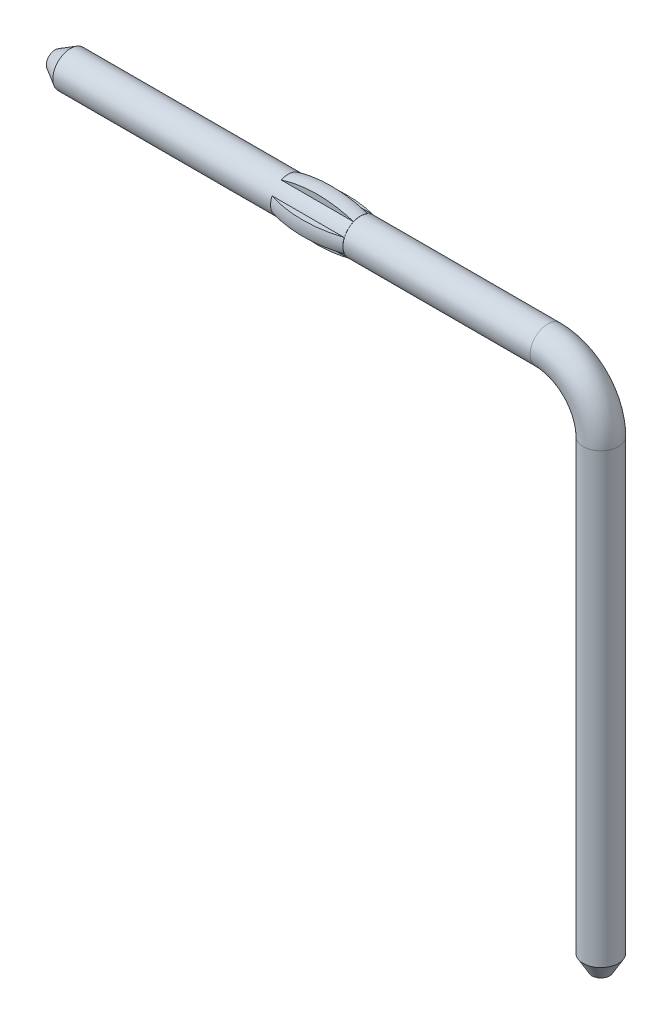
ISO-10303-21;
HEADER;
FILE_DESCRIPTION(('STEP AP214'),'2;1');
FILE_NAME('part.step','',(''),(''),'','','');
FILE_SCHEMA(('AUTOMOTIVE_DESIGN { 1 0 10303 214 1 1 1 1 }'));
ENDSEC;
DATA;
#1=APPLICATION_CONTEXT('core data for automotive mechanical design processes');
#2=APPLICATION_PROTOCOL_DEFINITION('international standard','automotive_design',2000,#1);
#3=PRODUCT_CONTEXT('',#1,'mechanical');
#4=PRODUCT('Part','Part','',(#3));
#5=PRODUCT_RELATED_PRODUCT_CATEGORY('part','',(#4));
#6=PRODUCT_DEFINITION_FORMATION('','',#4);
#7=PRODUCT_DEFINITION_CONTEXT('part definition',#1,'design');
#8=PRODUCT_DEFINITION('design','',#6,#7);
#9=PRODUCT_DEFINITION_SHAPE('','',#8);
#10=(LENGTH_UNIT() NAMED_UNIT(*) SI_UNIT(.MILLI.,.METRE.));
#11=(NAMED_UNIT(*) PLANE_ANGLE_UNIT() SI_UNIT($,.RADIAN.));
#12=(NAMED_UNIT(*) SI_UNIT($,.STERADIAN.) SOLID_ANGLE_UNIT());
#13=UNCERTAINTY_MEASURE_WITH_UNIT(LENGTH_MEASURE(1.E-05),#10,'distance_accuracy_value','');
#14=(GEOMETRIC_REPRESENTATION_CONTEXT(3) GLOBAL_UNCERTAINTY_ASSIGNED_CONTEXT((#13)) GLOBAL_UNIT_ASSIGNED_CONTEXT((#10,
#11,#12)) REPRESENTATION_CONTEXT('',''));
#15=CARTESIAN_POINT('',(0.,0.,0.));
#16=DIRECTION('',(0.,0.,1.));
#17=DIRECTION('',(1.,0.,0.));
#18=AXIS2_PLACEMENT_3D('',#15,#16,#17);
#19=CARTESIAN_POINT('',(-7.7,0.,0.));
#20=DIRECTION('',(1.,0.,0.));
#21=DIRECTION('',(0.,0.,-1.));
#22=AXIS2_PLACEMENT_3D('',#19,#20,#21);
#23=PLANE('',#22);
#24=CARTESIAN_POINT('',(-7.69999999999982,0.,0.));
#25=DIRECTION('',(1.,0.,0.));
#26=DIRECTION('',(0.,0.,-1.));
#27=AXIS2_PLACEMENT_3D('',#24,#25,#26);
#28=CIRCLE('',#27,0.12499999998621);
#29=CARTESIAN_POINT('',(-7.69999999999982,0.,-0.12499999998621));
#30=VERTEX_POINT('',#29);
#31=EDGE_CURVE('E21',#30,#30,#28,.T.);
#32=ORIENTED_EDGE('',*,*,#31,.F.);
#33=EDGE_LOOP('',(#32));
#34=FACE_BOUND('',#33,.T.);
#35=ADVANCED_FACE('F16',(#34),#23,.F.);
#36=CARTESIAN_POINT('',(-7.7,0.1,0.2291287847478));
#37=DIRECTION('',(0.,-1.,0.));
#38=DIRECTION('',(0.,0.,-1.));
#39=AXIS2_PLACEMENT_3D('',#36,#37,#38);
#40=PLANE('',#39);
#41=CARTESIAN_POINT('',(-3.39000000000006,0.1,0.229128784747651));
#42=CARTESIAN_POINT('',(-3.42100227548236,0.1,0.239288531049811));
#43=CARTESIAN_POINT('',(-3.45232127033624,0.1,0.248453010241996));
#44=CARTESIAN_POINT('',(-3.51545487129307,0.1,0.26483020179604));
#45=CARTESIAN_POINT('',(-3.54726930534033,0.1,0.272043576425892));
#46=CARTESIAN_POINT('',(-3.6435182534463,0.1,0.290870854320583));
#47=CARTESIAN_POINT('',(-3.7085269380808,0.1,0.299597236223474));
#48=CARTESIAN_POINT('',(-3.86808650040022,0.1,0.311579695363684));
#49=CARTESIAN_POINT('',(-3.96298668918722,0.1,0.310709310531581));
#50=CARTESIAN_POINT('',(-4.10398407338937,0.1,0.297494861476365));
#51=CARTESIAN_POINT('',(-4.15072624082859,0.1,0.29111365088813));
#52=CARTESIAN_POINT('',(-4.24348691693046,0.1,0.274376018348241));
#53=CARTESIAN_POINT('',(-4.28950587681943,0.1,0.264022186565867));
#54=CARTESIAN_POINT('',(-4.3601591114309,0.1,0.244758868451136));
#55=CARTESIAN_POINT('',(-4.385185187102,0.1,0.237261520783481));
#56=CARTESIAN_POINT('',(-4.41000000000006,0.1,0.22912878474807));
#57=B_SPLINE_CURVE_WITH_KNOTS('',3,(#41,#42,#43,#44,#45,#46,#47,#48,#49,#50,#51,#52,#53,#54,#55,
#56),.UNSPECIFIED.,.F.,.F.,(4,2,2,2,2,2,2,4),(0.,0.0978417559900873,0.19565025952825,
0.391991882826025,0.6751725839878,0.816569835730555,0.957875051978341,1.03621668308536),.UNSPECIFIED.);
#58=CARTESIAN_POINT('',(-3.39,0.0999999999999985,0.229128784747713));
#59=VERTEX_POINT('',#58);
#60=CARTESIAN_POINT('',(-4.40999999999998,0.0999999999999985,0.229128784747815));
#61=VERTEX_POINT('',#60);
#62=EDGE_CURVE('E119',#59,#61,#57,.T.);
#63=ORIENTED_EDGE('',*,*,#62,.F.);
#64=DIRECTION('',(1.,0.,0.));
#65=VECTOR('',#64,1.);
#66=CARTESIAN_POINT('',(-7.7,0.099999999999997,0.229128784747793));
#67=LINE('',#66,#65);
#68=EDGE_CURVE('E93',#61,#59,#67,.T.);
#69=ORIENTED_EDGE('',*,*,#68,.F.);
#70=EDGE_LOOP('',(#63,#69));
#71=FACE_BOUND('',#70,.T.);
#72=ADVANCED_FACE('F130',(#71),#40,.F.);
#73=CARTESIAN_POINT('',(-7.7,-0.1,0.2291287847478));
#74=DIRECTION('',(0.,-1.,0.));
#75=DIRECTION('',(0.,0.,-1.));
#76=AXIS2_PLACEMENT_3D('',#73,#74,#75);
#77=PLANE('',#76);
#78=DIRECTION('',(1.,0.,0.));
#79=VECTOR('',#78,1.);
#80=CARTESIAN_POINT('',(-7.7,-0.099999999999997,0.229128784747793));
#81=LINE('',#80,#79);
#82=CARTESIAN_POINT('',(-3.39,-0.0999999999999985,0.229128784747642));
#83=VERTEX_POINT('',#82);
#84=CARTESIAN_POINT('',(-4.40999999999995,-0.0999999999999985,0.229128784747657));
#85=VERTEX_POINT('',#84);
#86=EDGE_CURVE('E86',#83,#85,#81,.F.);
#87=ORIENTED_EDGE('',*,*,#86,.F.);
#88=CARTESIAN_POINT('',(-4.40999999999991,-0.1,0.22912878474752));
#89=CARTESIAN_POINT('',(-4.37899772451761,-0.1,0.239288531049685));
#90=CARTESIAN_POINT('',(-4.34767872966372,-0.1,0.248453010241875));
#91=CARTESIAN_POINT('',(-4.28454512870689,-0.1,0.264830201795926));
#92=CARTESIAN_POINT('',(-4.25273069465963,-0.1,0.272043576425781));
#93=CARTESIAN_POINT('',(-4.15648174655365,-0.1,0.290870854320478));
#94=CARTESIAN_POINT('',(-4.09147306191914,-0.1,0.299597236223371));
#95=CARTESIAN_POINT('',(-3.93191349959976,-0.1,0.311579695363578));
#96=CARTESIAN_POINT('',(-3.83701331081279,-0.1,0.310709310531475));
#97=CARTESIAN_POINT('',(-3.6960159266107,-0.1,0.297494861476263));
#98=CARTESIAN_POINT('',(-3.6492737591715,-0.1,0.29111365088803));
#99=CARTESIAN_POINT('',(-3.55651308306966,-0.1,0.274376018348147));
#100=CARTESIAN_POINT('',(-3.51049412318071,-0.1,0.264022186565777));
#101=CARTESIAN_POINT('',(-3.43984088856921,-0.1,0.244758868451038));
#102=CARTESIAN_POINT('',(-3.41481481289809,-0.1,0.237261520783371));
#103=CARTESIAN_POINT('',(-3.38999999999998,-0.1,0.229128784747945));
#104=B_SPLINE_CURVE_WITH_KNOTS('',3,(#88,#89,#90,#91,#92,#93,#94,#95,#96,#97,#98,#99,#100,#101,
#102,#103),.UNSPECIFIED.,.F.,.F.,(4,2,2,2,2,2,2,4),(0.,0.0978417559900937,0.195650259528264,
0.391991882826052,0.675172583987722,0.816569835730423,0.957875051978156,1.03621668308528),.UNSPECIFIED.);
#105=EDGE_CURVE('E89',#85,#83,#104,.T.);
#106=ORIENTED_EDGE('',*,*,#105,.F.);
#107=EDGE_LOOP('',(#87,#106));
#108=FACE_BOUND('',#107,.T.);
#109=ADVANCED_FACE('F87',(#108),#77,.T.);
#110=CARTESIAN_POINT('',(-7.7,-0.3092329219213,0.1));
#111=DIRECTION('',(0.,0.,1.));
#112=DIRECTION('',(1.,0.,0.));
#113=AXIS2_PLACEMENT_3D('',#110,#111,#112);
#114=PLANE('',#113);
#115=DIRECTION('',(1.,0.,0.));
#116=VECTOR('',#115,1.);
#117=CARTESIAN_POINT('',(-7.7,-0.229128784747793,0.0999999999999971));
#118=LINE('',#117,#116);
#119=CARTESIAN_POINT('',(-4.40999999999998,-0.229128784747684,0.0999999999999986));
#120=VERTEX_POINT('',#119);
#121=CARTESIAN_POINT('',(-3.39,-0.229128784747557,0.0999999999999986));
#122=VERTEX_POINT('',#121);
#123=EDGE_CURVE('E114',#120,#122,#118,.T.);
#124=ORIENTED_EDGE('',*,*,#123,.F.);
#125=CARTESIAN_POINT('',(-3.39000000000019,-0.229128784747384,0.1));
#126=CARTESIAN_POINT('',(-3.4210022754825,-0.239288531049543,0.1));
#127=CARTESIAN_POINT('',(-3.45232127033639,-0.248453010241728,0.1));
#128=CARTESIAN_POINT('',(-3.51545487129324,-0.264830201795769,0.1));
#129=CARTESIAN_POINT('',(-3.5472693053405,-0.27204357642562,0.1));
#130=CARTESIAN_POINT('',(-3.6435182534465,-0.290870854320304,0.1));
#131=CARTESIAN_POINT('',(-3.70852693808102,-0.29959723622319,0.1));
#132=CARTESIAN_POINT('',(-3.86808650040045,-0.31157969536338,0.1));
#133=CARTESIAN_POINT('',(-3.96298668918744,-0.310709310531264,0.1));
#134=CARTESIAN_POINT('',(-4.10398407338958,-0.297494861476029,0.1));
#135=CARTESIAN_POINT('',(-4.1507262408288,-0.291113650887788,0.1));
#136=CARTESIAN_POINT('',(-4.24348691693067,-0.274376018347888,0.1));
#137=CARTESIAN_POINT('',(-4.28950587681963,-0.264022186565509,0.1));
#138=CARTESIAN_POINT('',(-4.360159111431,-0.244758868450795,0.1));
#139=CARTESIAN_POINT('',(-4.385185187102,-0.237261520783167,0.1));
#140=CARTESIAN_POINT('',(-4.40999999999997,-0.229128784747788,0.1));
#141=B_SPLINE_CURVE_WITH_KNOTS('',3,(#125,#126,#127,#128,#129,#130,#131,#132,#133,#134,#135,
#136,#137,#138,#139,#140),.UNSPECIFIED.,.F.,.F.,(4,2,2,2,2,2,2,4),(0.,0.0978417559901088,
0.195650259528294,0.391991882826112,0.675172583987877,0.816569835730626,0.957875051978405,
1.03621668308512),.UNSPECIFIED.);
#142=EDGE_CURVE('E108',#122,#120,#141,.T.);
#143=ORIENTED_EDGE('',*,*,#142,.F.);
#144=EDGE_LOOP('',(#124,#143));
#145=FACE_BOUND('',#144,.T.);
#146=ADVANCED_FACE('F157',(#145),#114,.T.);
#147=CARTESIAN_POINT('',(-7.7,-0.3092329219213,-0.1));
#148=DIRECTION('',(0.,0.,1.));
#149=DIRECTION('',(1.,0.,0.));
#150=AXIS2_PLACEMENT_3D('',#147,#148,#149);
#151=PLANE('',#150);
#152=CARTESIAN_POINT('',(-4.40999999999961,-0.229128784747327,-0.1));
#153=CARTESIAN_POINT('',(-4.3789977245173,-0.23928853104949,-0.1));
#154=CARTESIAN_POINT('',(-4.34767872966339,-0.248453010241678,-0.1));
#155=CARTESIAN_POINT('',(-4.28454512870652,-0.264830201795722,-0.1));
#156=CARTESIAN_POINT('',(-4.25273069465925,-0.272043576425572,-0.1));
#157=CARTESIAN_POINT('',(-4.15648174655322,-0.290870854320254,-0.1));
#158=CARTESIAN_POINT('',(-4.09147306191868,-0.299597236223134,-0.1));
#159=CARTESIAN_POINT('',(-3.93191349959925,-0.311579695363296,-0.1));
#160=CARTESIAN_POINT('',(-3.83701331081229,-0.310709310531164,-0.1));
#161=CARTESIAN_POINT('',(-3.6960159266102,-0.29749486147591,-0.1));
#162=CARTESIAN_POINT('',(-3.649273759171,-0.291113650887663,-0.1));
#163=CARTESIAN_POINT('',(-3.55651308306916,-0.274376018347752,-0.1));
#164=CARTESIAN_POINT('',(-3.51049412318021,-0.264022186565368,-0.1));
#165=CARTESIAN_POINT('',(-3.43984088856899,-0.244758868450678,-0.1));
#166=CARTESIAN_POINT('',(-3.41481481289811,-0.237261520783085,-0.1));
#167=CARTESIAN_POINT('',(-3.39000000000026,-0.229128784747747,-0.1));
#168=B_SPLINE_CURVE_WITH_KNOTS('',3,(#152,#153,#154,#155,#156,#157,#158,#159,#160,#161,#162,
#163,#164,#165,#166,#167),.UNSPECIFIED.,.F.,.F.,(4,2,2,2,2,2,2,4),(0.,0.0978417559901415,
0.195650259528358,0.391991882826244,0.675172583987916,0.816569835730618,0.95787505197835,
1.03621668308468),.UNSPECIFIED.);
#169=CARTESIAN_POINT('',(-4.40999999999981,-0.22912878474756,-0.0999999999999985));
#170=VERTEX_POINT('',#169);
#171=CARTESIAN_POINT('',(-3.39000000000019,-0.229128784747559,-0.0999999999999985));
#172=VERTEX_POINT('',#171);
#173=EDGE_CURVE('E146',#170,#172,#168,.T.);
#174=ORIENTED_EDGE('',*,*,#173,.F.);
#175=DIRECTION('',(1.,0.,0.));
#176=VECTOR('',#175,1.);
#177=CARTESIAN_POINT('',(-7.7,-0.229128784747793,-0.0999999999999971));
#178=LINE('',#177,#176);
#179=EDGE_CURVE('E219',#172,#170,#178,.F.);
#180=ORIENTED_EDGE('',*,*,#179,.F.);
#181=EDGE_LOOP('',(#174,#180));
#182=FACE_BOUND('',#181,.T.);
#183=ADVANCED_FACE('F160',(#182),#151,.F.);
#184=CARTESIAN_POINT('',(-7.48349364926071,0.,0.));
#185=DIRECTION('',(1.,0.,0.));
#186=DIRECTION('',(0.,0.,-1.));
#187=AXIS2_PLACEMENT_3D('',#184,#185,#186);
#188=CONICAL_SURFACE('',#187,0.249999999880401,0.523598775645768);
#189=CARTESIAN_POINT('',(-7.483493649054,0.,0.));
#190=DIRECTION('',(1.,0.,0.));
#191=DIRECTION('',(0.,0.,-1.));
#192=AXIS2_PLACEMENT_3D('',#189,#190,#191);
#193=CIRCLE('',#192,0.25);
#194=CARTESIAN_POINT('',(-7.483493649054,0.,-0.25));
#195=VERTEX_POINT('',#194);
#196=EDGE_CURVE('E213',#195,#195,#193,.T.);
#197=ORIENTED_EDGE('',*,*,#196,.F.);
#198=EDGE_LOOP('',(#197));
#199=FACE_BOUND('',#198,.T.);
#200=ORIENTED_EDGE('',*,*,#31,.T.);
#201=EDGE_LOOP('',(#200));
#202=FACE_BOUND('',#201,.T.);
#203=ADVANCED_FACE('F297',(#199,#202),#188,.T.);
#204=CARTESIAN_POINT('',(-7.7,0.1,-0.2291287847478));
#205=DIRECTION('',(0.,1.,0.));
#206=DIRECTION('',(0.,0.,1.));
#207=AXIS2_PLACEMENT_3D('',#204,#205,#206);
#208=PLANE('',#207);
#209=DIRECTION('',(1.,0.,0.));
#210=VECTOR('',#209,1.);
#211=CARTESIAN_POINT('',(-7.7,0.0999999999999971,-0.229128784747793));
#212=LINE('',#211,#210);
#213=CARTESIAN_POINT('',(-3.39000000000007,0.0999999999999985,-0.229128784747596));
#214=VERTEX_POINT('',#213);
#215=CARTESIAN_POINT('',(-4.40999999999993,0.0999999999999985,-0.229128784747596));
#216=VERTEX_POINT('',#215);
#217=EDGE_CURVE('E212',#214,#216,#212,.F.);
#218=ORIENTED_EDGE('',*,*,#217,.F.);
#219=CARTESIAN_POINT('',(-4.40999999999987,0.1,-0.229128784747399));
#220=CARTESIAN_POINT('',(-4.37899772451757,0.1,-0.239288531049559));
#221=CARTESIAN_POINT('',(-4.34767872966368,0.1,-0.248453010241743));
#222=CARTESIAN_POINT('',(-4.28454512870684,0.1,-0.264830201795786));
#223=CARTESIAN_POINT('',(-4.25273069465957,0.1,-0.272043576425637));
#224=CARTESIAN_POINT('',(-4.15648174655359,0.1,-0.290870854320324));
#225=CARTESIAN_POINT('',(-4.09147306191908,0.1,-0.299597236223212));
#226=CARTESIAN_POINT('',(-3.93191349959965,0.1,-0.311579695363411));
#227=CARTESIAN_POINT('',(-3.83701331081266,0.1,-0.310709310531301));
#228=CARTESIAN_POINT('',(-3.69601592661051,0.1,-0.297494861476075));
#229=CARTESIAN_POINT('',(-3.64927375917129,0.1,-0.291113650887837));
#230=CARTESIAN_POINT('',(-3.55651308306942,0.1,-0.274376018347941));
#231=CARTESIAN_POINT('',(-3.51049412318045,0.1,-0.264022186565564));
#232=CARTESIAN_POINT('',(-3.43984088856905,0.1,-0.244758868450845));
#233=CARTESIAN_POINT('',(-3.41481481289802,0.1,-0.23726152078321));
#234=CARTESIAN_POINT('',(-3.39000000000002,0.1,-0.229128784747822));
#235=B_SPLINE_CURVE_WITH_KNOTS('',3,(#219,#220,#221,#222,#223,#224,#225,#226,#227,#228,#229,
#230,#231,#232,#233,#234),.UNSPECIFIED.,.F.,.F.,(4,2,2,2,2,2,2,4),(0.,0.0978417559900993,
0.195650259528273,0.391991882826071,0.675172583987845,0.816569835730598,0.957875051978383,
1.0362166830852),.UNSPECIFIED.);
#236=EDGE_CURVE('E223',#216,#214,#235,.T.);
#237=ORIENTED_EDGE('',*,*,#236,.F.);
#238=EDGE_LOOP('',(#218,#237));
#239=FACE_BOUND('',#238,.T.);
#240=ADVANCED_FACE('F273',(#239),#208,.T.);
#241=CARTESIAN_POINT('',(-7.7,-0.1,-0.2291287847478));
#242=DIRECTION('',(0.,1.,0.));
#243=DIRECTION('',(0.,0.,1.));
#244=AXIS2_PLACEMENT_3D('',#241,#242,#243);
#245=PLANE('',#244);
#246=CARTESIAN_POINT('',(-3.3900000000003,-0.1,-0.229128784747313));
#247=CARTESIAN_POINT('',(-3.42100227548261,-0.1,-0.239288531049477));
#248=CARTESIAN_POINT('',(-3.45232127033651,-0.1,-0.248453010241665));
#249=CARTESIAN_POINT('',(-3.51545487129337,-0.1,-0.264830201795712));
#250=CARTESIAN_POINT('',(-3.54726930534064,-0.1,-0.272043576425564));
#251=CARTESIAN_POINT('',(-3.64351825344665,-0.1,-0.29087085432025));
#252=CARTESIAN_POINT('',(-3.70852693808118,-0.1,-0.299597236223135));
#253=CARTESIAN_POINT('',(-3.8680865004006,-0.1,-0.31157969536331));
#254=CARTESIAN_POINT('',(-3.96298668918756,-0.1,-0.310709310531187));
#255=CARTESIAN_POINT('',(-4.10398407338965,-0.1,-0.297494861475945));
#256=CARTESIAN_POINT('',(-4.15072624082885,-0.1,-0.291113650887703));
#257=CARTESIAN_POINT('',(-4.24348691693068,-0.1,-0.274376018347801));
#258=CARTESIAN_POINT('',(-4.28950587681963,-0.1,-0.264022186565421));
#259=CARTESIAN_POINT('',(-4.36015911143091,-0.1,-0.244758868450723));
#260=CARTESIAN_POINT('',(-4.38518518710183,-0.1,-0.237261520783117));
#261=CARTESIAN_POINT('',(-4.40999999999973,-0.1,-0.229128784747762));
#262=B_SPLINE_CURVE_WITH_KNOTS('',3,(#246,#247,#248,#249,#250,#251,#252,#253,#254,#255,#256,
#257,#258,#259,#260,#261),.UNSPECIFIED.,.F.,.F.,(4,2,2,2,2,2,2,4),(0.,0.0978417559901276,
0.195650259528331,0.391991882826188,0.675172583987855,0.816569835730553,0.957875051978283,
1.03621668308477),.UNSPECIFIED.);
#263=CARTESIAN_POINT('',(-3.39000000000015,-0.0999999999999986,-0.229128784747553));
#264=VERTEX_POINT('',#263);
#265=CARTESIAN_POINT('',(-4.40999999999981,-0.0999999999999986,-0.229128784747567));
#266=VERTEX_POINT('',#265);
#267=EDGE_CURVE('E276',#264,#266,#262,.T.);
#268=ORIENTED_EDGE('',*,*,#267,.F.);
#269=DIRECTION('',(1.,0.,0.));
#270=VECTOR('',#269,1.);
#271=CARTESIAN_POINT('',(-7.7,-0.0999999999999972,-0.229128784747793));
#272=LINE('',#271,#270);
#273=EDGE_CURVE('E217',#266,#264,#272,.T.);
#274=ORIENTED_EDGE('',*,*,#273,.F.);
#275=EDGE_LOOP('',(#268,#274));
#276=FACE_BOUND('',#275,.T.);
#277=ADVANCED_FACE('F268',(#276),#245,.F.);
#278=CARTESIAN_POINT('',(-7.7,0.3092329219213,-0.1));
#279=DIRECTION('',(0.,0.,-1.));
#280=DIRECTION('',(-1.,0.,0.));
#281=AXIS2_PLACEMENT_3D('',#278,#279,#280);
#282=PLANE('',#281);
#283=DIRECTION('',(1.,0.,0.));
#284=VECTOR('',#283,1.);
#285=CARTESIAN_POINT('',(-7.7,0.229128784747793,-0.0999999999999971));
#286=LINE('',#285,#284);
#287=CARTESIAN_POINT('',(-4.40999999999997,0.229128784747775,-0.0999999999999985));
#288=VERTEX_POINT('',#287);
#289=CARTESIAN_POINT('',(-3.39000000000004,0.229128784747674,-0.0999999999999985));
#290=VERTEX_POINT('',#289);
#291=EDGE_CURVE('E209',#288,#290,#286,.T.);
#292=ORIENTED_EDGE('',*,*,#291,.F.);
#293=CARTESIAN_POINT('',(-3.39000000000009,0.229128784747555,-0.1));
#294=CARTESIAN_POINT('',(-3.42100227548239,0.23928853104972,-0.1));
#295=CARTESIAN_POINT('',(-3.45232127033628,0.24845301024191,-0.1));
#296=CARTESIAN_POINT('',(-3.51545487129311,0.26483020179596,-0.1));
#297=CARTESIAN_POINT('',(-3.54726930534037,0.272043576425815,-0.1));
#298=CARTESIAN_POINT('',(-3.64351825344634,0.290870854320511,-0.1));
#299=CARTESIAN_POINT('',(-3.70852693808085,0.299597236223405,-0.1));
#300=CARTESIAN_POINT('',(-3.86808650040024,0.311579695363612,-0.1));
#301=CARTESIAN_POINT('',(-3.96298668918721,0.310709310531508,-0.1));
#302=CARTESIAN_POINT('',(-4.1039840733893,0.297494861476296,-0.1));
#303=CARTESIAN_POINT('',(-4.15072624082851,0.291113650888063,-0.1));
#304=CARTESIAN_POINT('',(-4.24348691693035,0.27437601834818,-0.1));
#305=CARTESIAN_POINT('',(-4.2895058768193,0.264022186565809,-0.1));
#306=CARTESIAN_POINT('',(-4.3601591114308,0.24475886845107,-0.1));
#307=CARTESIAN_POINT('',(-4.38518518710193,0.237261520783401,-0.1));
#308=CARTESIAN_POINT('',(-4.41000000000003,0.229128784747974,-0.1));
#309=B_SPLINE_CURVE_WITH_KNOTS('',3,(#293,#294,#295,#296,#297,#298,#299,#300,#301,#302,#303,
#304,#305,#306,#307,#308),.UNSPECIFIED.,.F.,.F.,(4,2,2,2,2,2,2,4),(0.,0.0978417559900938,
0.195650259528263,0.39199188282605,0.675172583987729,0.816569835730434,0.957875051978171,
1.03621668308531),.UNSPECIFIED.);
#310=EDGE_CURVE('E206',#290,#288,#309,.T.);
#311=ORIENTED_EDGE('',*,*,#310,.F.);
#312=EDGE_LOOP('',(#292,#311));
#313=FACE_BOUND('',#312,.T.);
#314=ADVANCED_FACE('F263',(#313),#282,.T.);
#315=CARTESIAN_POINT('',(-7.7,0.3092329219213,0.1));
#316=DIRECTION('',(0.,0.,-1.));
#317=DIRECTION('',(-1.,0.,0.));
#318=AXIS2_PLACEMENT_3D('',#315,#316,#317);
#319=PLANE('',#318);
#320=CARTESIAN_POINT('',(-4.40999999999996,0.22912878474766,0.1));
#321=CARTESIAN_POINT('',(-4.37899772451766,0.239288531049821,0.1));
#322=CARTESIAN_POINT('',(-4.34767872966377,0.248453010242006,0.1));
#323=CARTESIAN_POINT('',(-4.28454512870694,0.264830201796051,0.1));
#324=CARTESIAN_POINT('',(-4.25273069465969,0.272043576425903,0.1));
#325=CARTESIAN_POINT('',(-4.15648174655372,0.290870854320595,0.1));
#326=CARTESIAN_POINT('',(-4.09147306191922,0.299597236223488,0.1));
#327=CARTESIAN_POINT('',(-3.9319134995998,0.311579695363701,0.1));
#328=CARTESIAN_POINT('',(-3.83701331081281,0.310709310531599,0.1));
#329=CARTESIAN_POINT('',(-3.69601592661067,0.297494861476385,0.1));
#330=CARTESIAN_POINT('',(-3.64927375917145,0.291113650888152,0.1));
#331=CARTESIAN_POINT('',(-3.55651308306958,0.274376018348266,0.1));
#332=CARTESIAN_POINT('',(-3.51049412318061,0.264022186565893,0.1));
#333=CARTESIAN_POINT('',(-3.43984088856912,0.24475886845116,0.1));
#334=CARTESIAN_POINT('',(-3.41481481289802,0.237261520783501,0.1));
#335=CARTESIAN_POINT('',(-3.38999999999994,0.229128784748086,0.1));
#336=B_SPLINE_CURVE_WITH_KNOTS('',3,(#320,#321,#322,#323,#324,#325,#326,#327,#328,#329,#330,
#331,#332,#333,#334,#335),.UNSPECIFIED.,.F.,.F.,(4,2,2,2,2,2,2,4),(0.,0.0978417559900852,
0.195650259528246,0.391991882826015,0.675172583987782,0.816569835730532,0.957875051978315,
1.03621668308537),.UNSPECIFIED.);
#337=CARTESIAN_POINT('',(-4.41,0.229128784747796,0.1));
#338=VERTEX_POINT('',#337);
#339=CARTESIAN_POINT('',(-3.39000000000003,0.229128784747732,0.1));
#340=VERTEX_POINT('',#339);
#341=EDGE_CURVE('E104',#338,#340,#336,.T.);
#342=ORIENTED_EDGE('',*,*,#341,.F.);
#343=DIRECTION('',(-1.,0.,0.));
#344=VECTOR('',#343,1.);
#345=CARTESIAN_POINT('',(-7.7,0.2291287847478,0.1));
#346=LINE('',#345,#344);
#347=EDGE_CURVE('E118',#340,#338,#346,.T.);
#348=ORIENTED_EDGE('',*,*,#347,.F.);
#349=EDGE_LOOP('',(#342,#348));
#350=FACE_BOUND('',#349,.T.);
#351=ADVANCED_FACE('F137',(#350),#319,.F.);
#352=CARTESIAN_POINT('',(-3.9,1.62847166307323E-13,1.37693675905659E-13));
#353=DIRECTION('',(1.,0.,0.));
#354=DIRECTION('',(0.,0.,-1.));
#355=AXIS2_PLACEMENT_3D('',#352,#353,#354);
#356=DEGENERATE_TOROIDAL_SURFACE('',#355,1.44649999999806,1.77149999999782,.F.);
#357=ORIENTED_EDGE('',*,*,#105,.T.);
#358=CARTESIAN_POINT('',(-3.39,1.62847166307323E-13,1.37693675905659E-13));
#359=DIRECTION('',(1.,0.,0.));
#360=DIRECTION('',(0.,0.,-1.));
#361=AXIS2_PLACEMENT_3D('',#358,#359,#360);
#362=CIRCLE('',#361,0.249999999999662);
#363=EDGE_CURVE('E96',#59,#83,#362,.T.);
#364=ORIENTED_EDGE('',*,*,#363,.F.);
#365=ORIENTED_EDGE('',*,*,#62,.T.);
#366=CARTESIAN_POINT('',(-4.40999999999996,1.39604582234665E-13,1.10900329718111E-13));
#367=DIRECTION('',(1.,0.,0.));
#368=DIRECTION('',(0.,1.,0.));
#369=AXIS2_PLACEMENT_3D('',#366,#367,#368);
#370=CIRCLE('',#369,0.249999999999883);
#371=EDGE_CURVE('E107',#61,#85,#370,.T.);
#372=ORIENTED_EDGE('',*,*,#371,.T.);
#373=EDGE_LOOP('',(#357,#364,#365,#372));
#374=FACE_BOUND('',#373,.T.);
#375=ADVANCED_FACE('F106',(#374),#356,.F.);
#376=CARTESIAN_POINT('',(-3.9,1.62847166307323E-13,1.37693675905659E-13));
#377=DIRECTION('',(1.,0.,0.));
#378=DIRECTION('',(0.,0.,-1.));
#379=AXIS2_PLACEMENT_3D('',#376,#377,#378);
#380=DEGENERATE_TOROIDAL_SURFACE('',#379,1.44649999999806,1.77149999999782,.F.);
#381=ORIENTED_EDGE('',*,*,#173,.T.);
#382=CARTESIAN_POINT('',(-3.39,1.62847166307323E-13,1.37693675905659E-13));
#383=DIRECTION('',(1.,0.,0.));
#384=DIRECTION('',(0.,0.,-1.));
#385=AXIS2_PLACEMENT_3D('',#382,#383,#384);
#386=CIRCLE('',#385,0.249999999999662);
#387=EDGE_CURVE('E103',#122,#172,#386,.T.);
#388=ORIENTED_EDGE('',*,*,#387,.F.);
#389=ORIENTED_EDGE('',*,*,#142,.T.);
#390=CARTESIAN_POINT('',(-4.41,0.,0.));
#391=DIRECTION('',(1.,0.,0.));
#392=DIRECTION('',(0.,0.,-1.));
#393=AXIS2_PLACEMENT_3D('',#390,#391,#392);
#394=CIRCLE('',#393,0.25);
#395=EDGE_CURVE('E222',#170,#120,#394,.F.);
#396=ORIENTED_EDGE('',*,*,#395,.F.);
#397=EDGE_LOOP('',(#381,#388,#389,#396));
#398=FACE_BOUND('',#397,.T.);
#399=ADVANCED_FACE('F136',(#398),#380,.F.);
#400=CARTESIAN_POINT('',(-3.9,1.62847166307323E-13,1.37693675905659E-13));
#401=DIRECTION('',(1.,0.,0.));
#402=DIRECTION('',(0.,0.,-1.));
#403=AXIS2_PLACEMENT_3D('',#400,#401,#402);
#404=DEGENERATE_TOROIDAL_SURFACE('',#403,1.44649999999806,1.77149999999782,.F.);
#405=ORIENTED_EDGE('',*,*,#236,.T.);
#406=CARTESIAN_POINT('',(-3.39000000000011,1.62847166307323E-13,1.37693675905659E-13));
#407=DIRECTION('',(1.,0.,0.));
#408=DIRECTION('',(0.,0.,-1.));
#409=AXIS2_PLACEMENT_3D('',#406,#407,#408);
#410=CIRCLE('',#409,0.249999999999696);
#411=EDGE_CURVE('E243',#264,#214,#410,.T.);
#412=ORIENTED_EDGE('',*,*,#411,.F.);
#413=ORIENTED_EDGE('',*,*,#267,.T.);
#414=CARTESIAN_POINT('',(-4.41,0.,0.));
#415=DIRECTION('',(1.,0.,0.));
#416=DIRECTION('',(0.,0.,-1.));
#417=AXIS2_PLACEMENT_3D('',#414,#415,#416);
#418=CIRCLE('',#417,0.25);
#419=EDGE_CURVE('E216',#216,#266,#418,.F.);
#420=ORIENTED_EDGE('',*,*,#419,.F.);
#421=EDGE_LOOP('',(#405,#412,#413,#420));
#422=FACE_BOUND('',#421,.T.);
#423=ADVANCED_FACE('F141',(#422),#404,.F.);
#424=CARTESIAN_POINT('',(-7.7,0.,0.));
#425=DIRECTION('',(1.,0.,0.));
#426=DIRECTION('',(0.,0.,-1.));
#427=AXIS2_PLACEMENT_3D('',#424,#425,#426);
#428=CYLINDRICAL_SURFACE('',#427,0.25);
#429=ORIENTED_EDGE('',*,*,#196,.T.);
#430=EDGE_LOOP('',(#429));
#431=FACE_BOUND('',#430,.T.);
#432=ORIENTED_EDGE('',*,*,#273,.T.);
#433=CARTESIAN_POINT('',(-3.39,0.,0.));
#434=DIRECTION('',(1.,0.,0.));
#435=DIRECTION('',(0.,0.,-1.));
#436=AXIS2_PLACEMENT_3D('',#433,#434,#435);
#437=CIRCLE('',#436,0.25);
#438=EDGE_CURVE('E246',#172,#264,#437,.T.);
#439=ORIENTED_EDGE('',*,*,#438,.F.);
#440=ORIENTED_EDGE('',*,*,#179,.T.);
#441=ORIENTED_EDGE('',*,*,#395,.T.);
#442=ORIENTED_EDGE('',*,*,#123,.T.);
#443=CARTESIAN_POINT('',(-3.39,0.,0.));
#444=DIRECTION('',(1.,0.,0.));
#445=DIRECTION('',(0.,0.,-1.));
#446=AXIS2_PLACEMENT_3D('',#443,#444,#445);
#447=CIRCLE('',#446,0.25);
#448=EDGE_CURVE('E81',#122,#83,#447,.F.);
#449=ORIENTED_EDGE('',*,*,#448,.T.);
#450=ORIENTED_EDGE('',*,*,#86,.T.);
#451=ORIENTED_EDGE('',*,*,#371,.F.);
#452=ORIENTED_EDGE('',*,*,#68,.T.);
#453=CARTESIAN_POINT('',(-3.39,0.,0.));
#454=DIRECTION('',(1.,0.,0.));
#455=DIRECTION('',(0.,0.,-1.));
#456=AXIS2_PLACEMENT_3D('',#453,#454,#455);
#457=CIRCLE('',#456,0.25);
#458=EDGE_CURVE('E99',#59,#340,#457,.F.);
#459=ORIENTED_EDGE('',*,*,#458,.T.);
#460=ORIENTED_EDGE('',*,*,#347,.T.);
#461=CARTESIAN_POINT('',(-4.40999999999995,1.38561037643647E-13,1.09585734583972E-13));
#462=DIRECTION('',(1.,0.,0.));
#463=DIRECTION('',(0.,1.,0.));
#464=AXIS2_PLACEMENT_3D('',#461,#462,#463);
#465=CIRCLE('',#464,0.249999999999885);
#466=EDGE_CURVE('E203',#288,#338,#465,.T.);
#467=ORIENTED_EDGE('',*,*,#466,.F.);
#468=ORIENTED_EDGE('',*,*,#291,.T.);
#469=CARTESIAN_POINT('',(-3.39,0.,0.));
#470=DIRECTION('',(1.,0.,0.));
#471=DIRECTION('',(0.,0.,-1.));
#472=AXIS2_PLACEMENT_3D('',#469,#470,#471);
#473=CIRCLE('',#472,0.25);
#474=EDGE_CURVE('E241',#214,#290,#473,.T.);
#475=ORIENTED_EDGE('',*,*,#474,.F.);
#476=ORIENTED_EDGE('',*,*,#217,.T.);
#477=ORIENTED_EDGE('',*,*,#419,.T.);
#478=EDGE_LOOP('',(#432,#439,#440,#441,#442,#449,#450,#451,#452,#459,#460,#467,#468,#475,#476,#477));
#479=FACE_BOUND('',#478,.T.);
#480=ADVANCED_FACE('F112',(#431,#479),#428,.T.);
#481=CARTESIAN_POINT('',(-3.9,1.62847166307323E-13,1.37693675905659E-13));
#482=DIRECTION('',(1.,0.,0.));
#483=DIRECTION('',(0.,0.,-1.));
#484=AXIS2_PLACEMENT_3D('',#481,#482,#483);
#485=DEGENERATE_TOROIDAL_SURFACE('',#484,1.44649999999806,1.77149999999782,.F.);
#486=ORIENTED_EDGE('',*,*,#341,.T.);
#487=CARTESIAN_POINT('',(-3.39,1.62847166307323E-13,1.37693675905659E-13));
#488=DIRECTION('',(1.,0.,0.));
#489=DIRECTION('',(0.,0.,-1.));
#490=AXIS2_PLACEMENT_3D('',#487,#488,#489);
#491=CIRCLE('',#490,0.249999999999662);
#492=EDGE_CURVE('E36',#290,#340,#491,.T.);
#493=ORIENTED_EDGE('',*,*,#492,.F.);
#494=ORIENTED_EDGE('',*,*,#310,.T.);
#495=ORIENTED_EDGE('',*,*,#466,.T.);
#496=EDGE_LOOP('',(#486,#493,#494,#495));
#497=FACE_BOUND('',#496,.T.);
#498=ADVANCED_FACE('F18',(#497),#485,.F.);
#499=CARTESIAN_POINT('',(-3.39,0.,0.));
#500=DIRECTION('',(1.,0.,0.));
#501=DIRECTION('',(0.,0.,-1.));
#502=AXIS2_PLACEMENT_3D('',#499,#500,#501);
#503=PLANE('',#502);
#504=CARTESIAN_POINT('',(-3.39,0.,0.));
#505=DIRECTION('',(1.,0.,0.));
#506=DIRECTION('',(0.,0.,-1.));
#507=AXIS2_PLACEMENT_3D('',#504,#505,#506);
#508=CIRCLE('',#507,0.2485);
#509=CARTESIAN_POINT('',(-3.39,0.,-0.2485));
#510=VERTEX_POINT('',#509);
#511=EDGE_CURVE('E202',#510,#510,#508,.T.);
#512=ORIENTED_EDGE('',*,*,#511,.F.);
#513=EDGE_LOOP('',(#512));
#514=FACE_BOUND('',#513,.T.);
#515=ORIENTED_EDGE('',*,*,#474,.T.);
#516=ORIENTED_EDGE('',*,*,#492,.T.);
#517=ORIENTED_EDGE('',*,*,#458,.F.);
#518=ORIENTED_EDGE('',*,*,#363,.T.);
#519=ORIENTED_EDGE('',*,*,#448,.F.);
#520=ORIENTED_EDGE('',*,*,#387,.T.);
#521=ORIENTED_EDGE('',*,*,#438,.T.);
#522=ORIENTED_EDGE('',*,*,#411,.T.);
#523=EDGE_LOOP('',(#515,#516,#517,#518,#519,#520,#521,#522));
#524=FACE_BOUND('',#523,.T.);
#525=ADVANCED_FACE('F98',(#514,#524),#503,.T.);
#526=CARTESIAN_POINT('',(-3.39,0.,0.));
#527=DIRECTION('',(1.,0.,0.));
#528=DIRECTION('',(0.,0.,-1.));
#529=AXIS2_PLACEMENT_3D('',#526,#527,#528);
#530=CYLINDRICAL_SURFACE('',#529,0.2485);
#531=CARTESIAN_POINT('',(-0.75,0.,0.));
#532=DIRECTION('',(1.,0.,0.));
#533=DIRECTION('',(0.,1.,0.));
#534=AXIS2_PLACEMENT_3D('',#531,#532,#533);
#535=CIRCLE('',#534,0.2485);
#536=CARTESIAN_POINT('',(-0.75,0.2485,0.));
#537=VERTEX_POINT('',#536);
#538=EDGE_CURVE('E198',#537,#537,#535,.T.);
#539=ORIENTED_EDGE('',*,*,#538,.F.);
#540=EDGE_LOOP('',(#539));
#541=FACE_BOUND('',#540,.T.);
#542=ORIENTED_EDGE('',*,*,#511,.T.);
#543=EDGE_LOOP('',(#542));
#544=FACE_BOUND('',#543,.T.);
#545=ADVANCED_FACE('F192',(#541,#544),#530,.T.);
#546=CARTESIAN_POINT('',(-0.75,-0.75,0.));
#547=DIRECTION('',(0.,0.,-1.));
#548=DIRECTION('',(0.,-1.,0.));
#549=AXIS2_PLACEMENT_3D('',#546,#547,#548);
#550=TOROIDAL_SURFACE('',#549,0.75,0.2485);
#551=CARTESIAN_POINT('',(0.,-0.75,0.));
#552=DIRECTION('',(0.,-1.,0.));
#553=DIRECTION('',(0.,0.,-1.));
#554=AXIS2_PLACEMENT_3D('',#551,#552,#553);
#555=CIRCLE('',#554,0.2485);
#556=CARTESIAN_POINT('',(0.,-0.75,-0.2485));
#557=VERTEX_POINT('',#556);
#558=EDGE_CURVE('E201',#557,#557,#555,.T.);
#559=ORIENTED_EDGE('',*,*,#558,.F.);
#560=EDGE_LOOP('',(#559));
#561=FACE_BOUND('',#560,.T.);
#562=ORIENTED_EDGE('',*,*,#538,.T.);
#563=EDGE_LOOP('',(#562));
#564=FACE_BOUND('',#563,.T.);
#565=ADVANCED_FACE('F187',(#561,#564),#550,.T.);
#566=CARTESIAN_POINT('',(0.,-7.28,0.));
#567=DIRECTION('',(0.,-1.,0.));
#568=DIRECTION('',(0.,0.,-1.));
#569=AXIS2_PLACEMENT_3D('',#566,#567,#568);
#570=PLANE('',#569);
#571=CARTESIAN_POINT('',(0.,-7.27999999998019,0.));
#572=DIRECTION('',(0.,1.,0.));
#573=DIRECTION('',(0.,0.,1.));
#574=AXIS2_PLACEMENT_3D('',#571,#572,#573);
#575=CIRCLE('',#574,0.125000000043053);
#576=CARTESIAN_POINT('',(0.,-7.27999999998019,0.125000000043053));
#577=VERTEX_POINT('',#576);
#578=EDGE_CURVE('E27',#577,#577,#575,.T.);
#579=ORIENTED_EDGE('',*,*,#578,.F.);
#580=EDGE_LOOP('',(#579));
#581=FACE_BOUND('',#580,.T.);
#582=ADVANCED_FACE('F179',(#581),#570,.T.);
#583=CARTESIAN_POINT('',(0.,-7.06609172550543,0.));
#584=DIRECTION('',(0.,1.,0.));
#585=DIRECTION('',(0.,0.,1.));
#586=AXIS2_PLACEMENT_3D('',#583,#584,#585);
#587=CONICAL_SURFACE('',#586,0.248499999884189,0.523598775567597);
#588=ORIENTED_EDGE('',*,*,#578,.T.);
#589=EDGE_LOOP('',(#588));
#590=FACE_BOUND('',#589,.T.);
#591=CARTESIAN_POINT('',(0.,-7.066091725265,0.));
#592=DIRECTION('',(0.,-1.,0.));
#593=DIRECTION('',(0.,0.,-1.));
#594=AXIS2_PLACEMENT_3D('',#591,#592,#593);
#595=CIRCLE('',#594,0.2485);
#596=CARTESIAN_POINT('',(0.,-7.066091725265,-0.2485));
#597=VERTEX_POINT('',#596);
#598=EDGE_CURVE('E11',#597,#597,#595,.F.);
#599=ORIENTED_EDGE('',*,*,#598,.F.);
#600=EDGE_LOOP('',(#599));
#601=FACE_BOUND('',#600,.T.);
#602=ADVANCED_FACE('F173',(#590,#601),#587,.T.);
#603=CARTESIAN_POINT('',(0.,-0.75,0.));
#604=DIRECTION('',(0.,-1.,0.));
#605=DIRECTION('',(0.,0.,-1.));
#606=AXIS2_PLACEMENT_3D('',#603,#604,#605);
#607=CYLINDRICAL_SURFACE('',#606,0.2485);
#608=ORIENTED_EDGE('',*,*,#558,.T.);
#609=EDGE_LOOP('',(#608));
#610=FACE_BOUND('',#609,.T.);
#611=ORIENTED_EDGE('',*,*,#598,.T.);
#612=EDGE_LOOP('',(#611));
#613=FACE_BOUND('',#612,.T.);
#614=ADVANCED_FACE('F171',(#610,#613),#607,.T.);
#615=CLOSED_SHELL('',(#35,#72,#109,#146,#183,#203,#240,#277,#314,#351,#375,#399,#423,#480,#498,
#525,#545,#565,#582,#602,#614));
#616=MANIFOLD_SOLID_BREP('B1',#615);
#617=ADVANCED_BREP_SHAPE_REPRESENTATION('',(#18,#616),#14);
#618=SHAPE_DEFINITION_REPRESENTATION(#9,#617);
ENDSEC;
END-ISO-10303-21;
